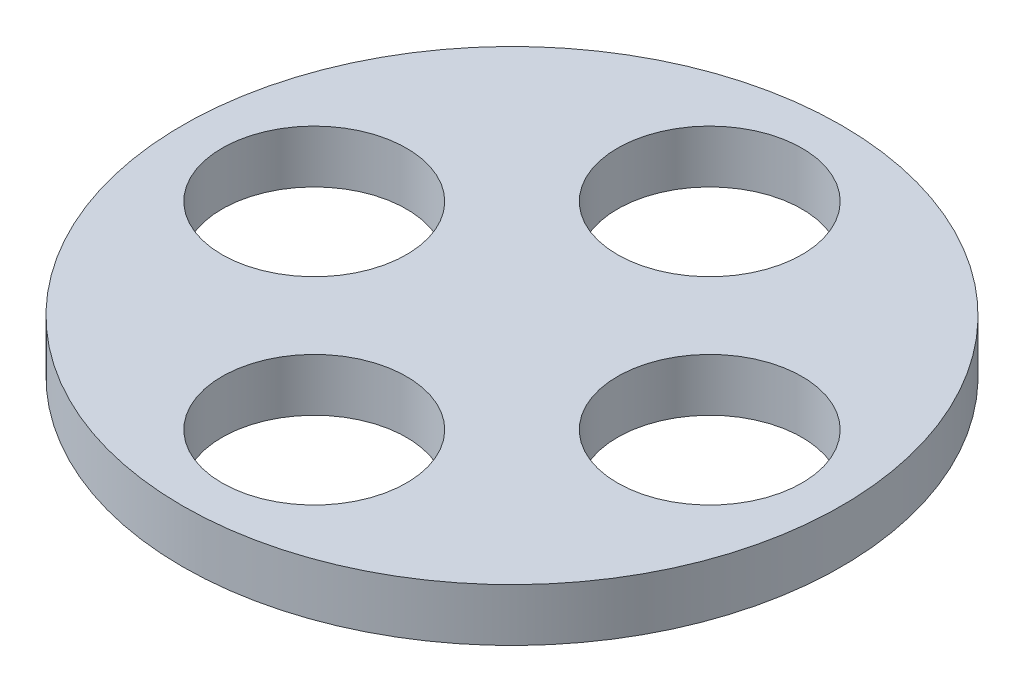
from build123d import *

# Parameters (mm, degrees)
SKETCH1_R           = 125
BOSS_EXTRUDE1_DEPTH = 20
SKETCH2_R           = 35
CUT_EXTRUDE1_DEPTH  = 178.904468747


with BuildPart() as part:
    # Sketch1 → Boss-Extrude1 (new body)
    with BuildSketch(Plane(origin=(0, 0, 0), x_dir=(1, 0, 0), z_dir=(0, 1, 0))):
        with Locations(Location((0, 0, 0), (0, 0, 270))):
            Circle(SKETCH1_R)
    extrude(amount=BOSS_EXTRUDE1_DEPTH)

    # Sketch2 → Cut-Extrude1 (cut, through all)
    with BuildSketch(Plane(origin=(0, 20, 0), x_dir=(1, 0, 0), z_dir=(0, 1, 0))):
        with Locations(Location((0, 75, 0), (0, 0, 270))):
            Circle(SKETCH2_R)
        with Locations(Location((75, 0, 0), (0, 0, 270))):
            Circle(SKETCH2_R)
        with Locations(Location((0, -75, 0), (0, 0, 270))):
            Circle(SKETCH2_R)
        with Locations(Location((-75, 0, 0), (0, 0, 270))):
            Circle(SKETCH2_R)
    extrude(amount=-CUT_EXTRUDE1_DEPTH, mode=Mode.SUBTRACT)


solid = part.part
